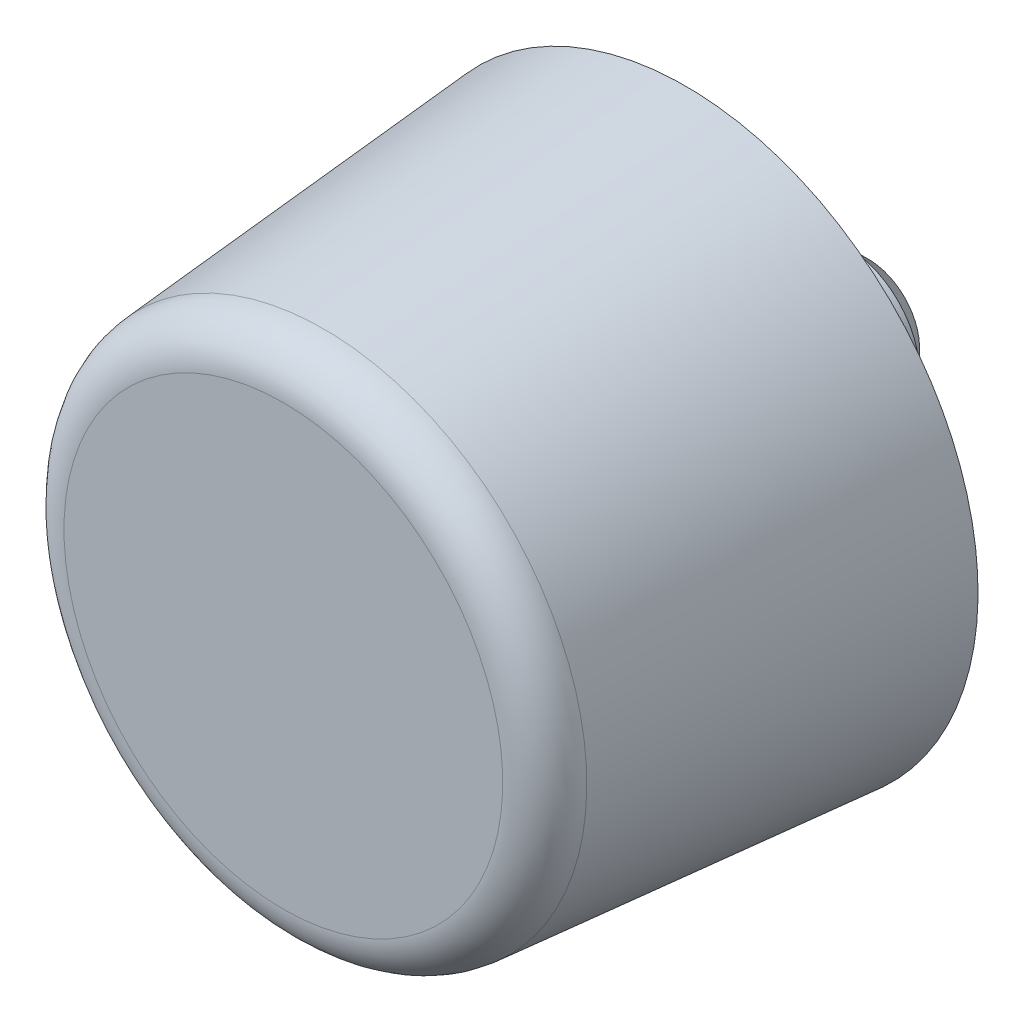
ISO-10303-21;
HEADER;
FILE_DESCRIPTION(('STEP AP214'),'2;1');
FILE_NAME('part.step','',(''),(''),'','','');
FILE_SCHEMA(('AUTOMOTIVE_DESIGN { 1 0 10303 214 1 1 1 1 }'));
ENDSEC;
DATA;
#1=APPLICATION_CONTEXT('core data for automotive mechanical design processes');
#2=APPLICATION_PROTOCOL_DEFINITION('international standard','automotive_design',2000,#1);
#3=PRODUCT_CONTEXT('',#1,'mechanical');
#4=PRODUCT('Part','Part','',(#3));
#5=PRODUCT_RELATED_PRODUCT_CATEGORY('part','',(#4));
#6=PRODUCT_DEFINITION_FORMATION('','',#4);
#7=PRODUCT_DEFINITION_CONTEXT('part definition',#1,'design');
#8=PRODUCT_DEFINITION('design','',#6,#7);
#9=PRODUCT_DEFINITION_SHAPE('','',#8);
#10=(LENGTH_UNIT() NAMED_UNIT(*) SI_UNIT(.MILLI.,.METRE.));
#11=(NAMED_UNIT(*) PLANE_ANGLE_UNIT() SI_UNIT($,.RADIAN.));
#12=(NAMED_UNIT(*) SI_UNIT($,.STERADIAN.) SOLID_ANGLE_UNIT());
#13=UNCERTAINTY_MEASURE_WITH_UNIT(LENGTH_MEASURE(1.E-05),#10,'distance_accuracy_value','');
#14=(GEOMETRIC_REPRESENTATION_CONTEXT(3) GLOBAL_UNCERTAINTY_ASSIGNED_CONTEXT((#13)) GLOBAL_UNIT_ASSIGNED_CONTEXT((#10,
#11,#12)) REPRESENTATION_CONTEXT('',''));
#15=CARTESIAN_POINT('',(0.,0.,0.));
#16=DIRECTION('',(0.,0.,1.));
#17=DIRECTION('',(1.,0.,0.));
#18=AXIS2_PLACEMENT_3D('',#15,#16,#17);
#19=CARTESIAN_POINT('',(0.,0.,22.));
#20=DIRECTION('',(0.,0.,1.));
#21=DIRECTION('',(0.,-1.,0.));
#22=AXIS2_PLACEMENT_3D('',#19,#20,#21);
#23=CYLINDRICAL_SURFACE('',#22,14.4);
#24=CARTESIAN_POINT('',(0.,0.,0.));
#25=DIRECTION('',(0.,0.,1.));
#26=DIRECTION('',(0.,-1.,0.));
#27=AXIS2_PLACEMENT_3D('',#24,#25,#26);
#28=CIRCLE('',#27,14.4);
#29=CARTESIAN_POINT('',(0.,-14.4,0.));
#30=VERTEX_POINT('',#29);
#31=EDGE_CURVE('E27',#30,#30,#28,.T.);
#32=ORIENTED_EDGE('',*,*,#31,.F.);
#33=EDGE_LOOP('',(#32));
#34=FACE_BOUND('',#33,.T.);
#35=CARTESIAN_POINT('',(0.,0.,0.049999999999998));
#36=DIRECTION('',(0.,0.,1.));
#37=DIRECTION('',(0.,-1.,0.));
#38=AXIS2_PLACEMENT_3D('',#35,#36,#37);
#39=CIRCLE('',#38,14.4);
#40=CARTESIAN_POINT('',(0.,-14.4,0.049999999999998));
#41=VERTEX_POINT('',#40);
#42=EDGE_CURVE('E44',#41,#41,#39,.T.);
#43=ORIENTED_EDGE('',*,*,#42,.T.);
#44=EDGE_LOOP('',(#43));
#45=FACE_BOUND('',#44,.T.);
#46=ADVANCED_FACE('F12',(#34,#45),#23,.F.);
#47=CARTESIAN_POINT('',(14.4,0.,0.));
#48=DIRECTION('',(0.,0.,1.));
#49=DIRECTION('',(0.,-1.,0.));
#50=AXIS2_PLACEMENT_3D('',#47,#48,#49);
#51=PLANE('',#50);
#52=CARTESIAN_POINT('',(0.,0.,0.));
#53=DIRECTION('',(0.,0.,1.));
#54=DIRECTION('',(0.,-1.,0.));
#55=AXIS2_PLACEMENT_3D('',#52,#53,#54);
#56=CIRCLE('',#55,16.);
#57=CARTESIAN_POINT('',(0.,-16.,0.));
#58=VERTEX_POINT('',#57);
#59=EDGE_CURVE('E32',#58,#58,#56,.T.);
#60=ORIENTED_EDGE('',*,*,#59,.F.);
#61=EDGE_LOOP('',(#60));
#62=FACE_BOUND('',#61,.T.);
#63=ORIENTED_EDGE('',*,*,#31,.T.);
#64=EDGE_LOOP('',(#63));
#65=FACE_BOUND('',#64,.T.);
#66=ADVANCED_FACE('F72',(#62,#65),#51,.F.);
#67=CARTESIAN_POINT('',(0.,0.,0.));
#68=DIRECTION('',(0.,0.,-1.));
#69=DIRECTION('',(0.,1.,0.));
#70=AXIS2_PLACEMENT_3D('',#67,#68,#69);
#71=CONICAL_SURFACE('',#70,16.,0.0810513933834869);
#72=CARTESIAN_POINT('',(0.,0.,19.7943104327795));
#73=DIRECTION('',(0.,0.,1.));
#74=DIRECTION('',(0.,-1.,0.));
#75=AXIS2_PLACEMENT_3D('',#72,#73,#74);
#76=CIRCLE('',#75,14.3921211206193);
#77=CARTESIAN_POINT('',(0.,-14.3921211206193,19.7943104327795));
#78=VERTEX_POINT('',#77);
#79=EDGE_CURVE('E35',#78,#78,#76,.T.);
#80=ORIENTED_EDGE('',*,*,#79,.F.);
#81=EDGE_LOOP('',(#80));
#82=FACE_BOUND('',#81,.T.);
#83=ORIENTED_EDGE('',*,*,#59,.T.);
#84=EDGE_LOOP('',(#83));
#85=FACE_BOUND('',#84,.T.);
#86=ADVANCED_FACE('F77',(#82,#85),#71,.T.);
#87=CARTESIAN_POINT('',(0.,0.,19.6));
#88=DIRECTION('',(0.,0.,1.));
#89=DIRECTION('',(0.,-1.,0.));
#90=AXIS2_PLACEMENT_3D('',#87,#88,#89);
#91=TOROIDAL_SURFACE('',#90,12.,2.4);
#92=ORIENTED_EDGE('',*,*,#79,.T.);
#93=EDGE_LOOP('',(#92));
#94=FACE_BOUND('',#93,.T.);
#95=CARTESIAN_POINT('',(0.,0.,22.));
#96=DIRECTION('',(0.,0.,1.));
#97=DIRECTION('',(0.,-1.,0.));
#98=AXIS2_PLACEMENT_3D('',#95,#96,#97);
#99=CIRCLE('',#98,12.);
#100=CARTESIAN_POINT('',(0.,-12.,22.));
#101=VERTEX_POINT('',#100);
#102=EDGE_CURVE('E38',#101,#101,#99,.T.);
#103=ORIENTED_EDGE('',*,*,#102,.F.);
#104=EDGE_LOOP('',(#103));
#105=FACE_BOUND('',#104,.T.);
#106=ADVANCED_FACE('F84',(#94,#105),#91,.T.);
#107=CARTESIAN_POINT('',(12.,0.,22.));
#108=DIRECTION('',(0.,0.,-1.));
#109=DIRECTION('',(0.,1.,0.));
#110=AXIS2_PLACEMENT_3D('',#107,#108,#109);
#111=PLANE('',#110);
#112=ORIENTED_EDGE('',*,*,#102,.T.);
#113=EDGE_LOOP('',(#112));
#114=FACE_BOUND('',#113,.T.);
#115=ADVANCED_FACE('F59',(#114),#111,.F.);
#116=CARTESIAN_POINT('',(0.,0.,0.));
#117=DIRECTION('',(0.,0.,1.));
#118=DIRECTION('',(0.,-1.,0.));
#119=AXIS2_PLACEMENT_3D('',#116,#117,#118);
#120=PLANE('',#119);
#121=CARTESIAN_POINT('',(0.,0.,0.));
#122=DIRECTION('',(0.,0.,1.));
#123=DIRECTION('',(0.,-1.,0.));
#124=AXIS2_PLACEMENT_3D('',#121,#122,#123);
#125=CIRCLE('',#124,14.35);
#126=CARTESIAN_POINT('',(0.,-14.35,0.));
#127=VERTEX_POINT('',#126);
#128=EDGE_CURVE('E41',#127,#127,#125,.T.);
#129=ORIENTED_EDGE('',*,*,#128,.F.);
#130=EDGE_LOOP('',(#129));
#131=FACE_BOUND('',#130,.T.);
#132=CARTESIAN_POINT('',(0.,0.,0.));
#133=DIRECTION('',(0.,0.,1.));
#134=DIRECTION('',(0.,-1.,0.));
#135=AXIS2_PLACEMENT_3D('',#132,#133,#134);
#136=CIRCLE('',#135,4.);
#137=CARTESIAN_POINT('',(0.,-4.,0.));
#138=VERTEX_POINT('',#137);
#139=EDGE_CURVE('E23',#138,#138,#136,.T.);
#140=ORIENTED_EDGE('',*,*,#139,.T.);
#141=EDGE_LOOP('',(#140));
#142=FACE_BOUND('',#141,.T.);
#143=ADVANCED_FACE('F53',(#131,#142),#120,.F.);
#144=CARTESIAN_POINT('',(0.,0.,0.));
#145=DIRECTION('',(0.,0.,1.));
#146=DIRECTION('',(0.,-1.,0.));
#147=AXIS2_PLACEMENT_3D('',#144,#145,#146);
#148=CONICAL_SURFACE('',#147,14.35,0.785398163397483);
#149=ORIENTED_EDGE('',*,*,#42,.F.);
#150=EDGE_LOOP('',(#149));
#151=FACE_BOUND('',#150,.T.);
#152=ORIENTED_EDGE('',*,*,#128,.T.);
#153=EDGE_LOOP('',(#152));
#154=FACE_BOUND('',#153,.T.);
#155=ADVANCED_FACE('F49',(#151,#154),#148,.T.);
#156=CARTESIAN_POINT('',(0.,0.,22.));
#157=DIRECTION('',(0.,0.,1.));
#158=DIRECTION('',(0.,-1.,0.));
#159=AXIS2_PLACEMENT_3D('',#156,#157,#158);
#160=CYLINDRICAL_SURFACE('',#159,4.);
#161=CARTESIAN_POINT('',(0.,0.,-8.8));
#162=DIRECTION('',(0.,0.,1.));
#163=DIRECTION('',(0.,-1.,0.));
#164=AXIS2_PLACEMENT_3D('',#161,#162,#163);
#165=CIRCLE('',#164,4.);
#166=CARTESIAN_POINT('',(0.,-4.,-8.8));
#167=VERTEX_POINT('',#166);
#168=EDGE_CURVE('E8',#167,#167,#165,.T.);
#169=ORIENTED_EDGE('',*,*,#168,.T.);
#170=EDGE_LOOP('',(#169));
#171=FACE_BOUND('',#170,.T.);
#172=ORIENTED_EDGE('',*,*,#139,.F.);
#173=EDGE_LOOP('',(#172));
#174=FACE_BOUND('',#173,.T.);
#175=ADVANCED_FACE('F52',(#171,#174),#160,.T.);
#176=CARTESIAN_POINT('',(0.,0.,-10.));
#177=DIRECTION('',(0.,0.,1.));
#178=DIRECTION('',(0.,-1.,0.));
#179=AXIS2_PLACEMENT_3D('',#176,#177,#178);
#180=PLANE('',#179);
#181=CARTESIAN_POINT('',(0.,0.,-10.));
#182=DIRECTION('',(0.,0.,1.));
#183=DIRECTION('',(0.,-1.,0.));
#184=AXIS2_PLACEMENT_3D('',#181,#182,#183);
#185=CIRCLE('',#184,2.8);
#186=CARTESIAN_POINT('',(0.,-2.8,-10.));
#187=VERTEX_POINT('',#186);
#188=EDGE_CURVE('E19',#187,#187,#185,.F.);
#189=ORIENTED_EDGE('',*,*,#188,.T.);
#190=EDGE_LOOP('',(#189));
#191=FACE_BOUND('',#190,.T.);
#192=ADVANCED_FACE('F64',(#191),#180,.F.);
#193=CARTESIAN_POINT('',(0.,0.,-10.));
#194=DIRECTION('',(0.,0.,1.));
#195=DIRECTION('',(0.,-1.,0.));
#196=AXIS2_PLACEMENT_3D('',#193,#194,#195);
#197=CONICAL_SURFACE('',#196,2.8,0.785398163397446);
#198=ORIENTED_EDGE('',*,*,#168,.F.);
#199=EDGE_LOOP('',(#198));
#200=FACE_BOUND('',#199,.T.);
#201=ORIENTED_EDGE('',*,*,#188,.F.);
#202=EDGE_LOOP('',(#201));
#203=FACE_BOUND('',#202,.T.);
#204=ADVANCED_FACE('F14',(#200,#203),#197,.T.);
#205=CLOSED_SHELL('',(#46,#66,#86,#106,#115,#143,#155,#175,#192,#204));
#206=MANIFOLD_SOLID_BREP('B1',#205);
#207=ADVANCED_BREP_SHAPE_REPRESENTATION('',(#18,#206),#14);
#208=SHAPE_DEFINITION_REPRESENTATION(#9,#207);
ENDSEC;
END-ISO-10303-21;
